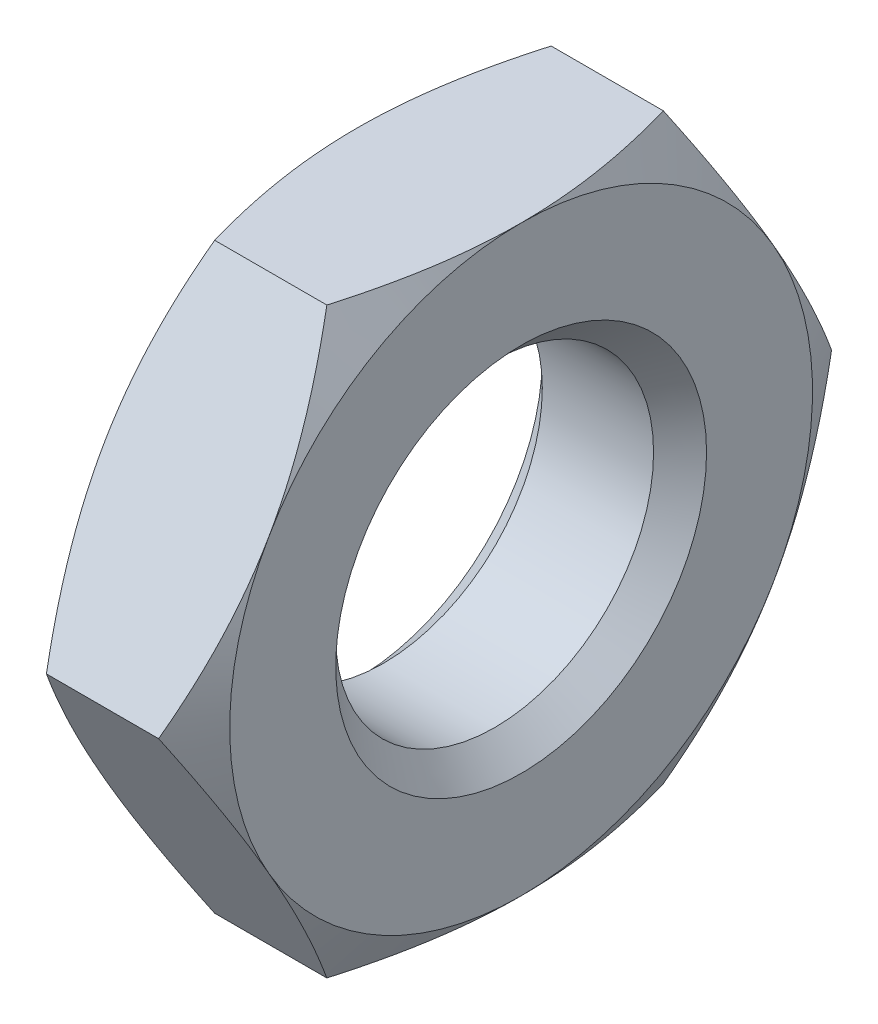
ISO-10303-21;
HEADER;
FILE_DESCRIPTION(('STEP AP214'),'2;1');
FILE_NAME('part.step','',(''),(''),'','','');
FILE_SCHEMA(('AUTOMOTIVE_DESIGN { 1 0 10303 214 1 1 1 1 }'));
ENDSEC;
DATA;
#1=APPLICATION_CONTEXT('core data for automotive mechanical design processes');
#2=APPLICATION_PROTOCOL_DEFINITION('international standard','automotive_design',2000,#1);
#3=PRODUCT_CONTEXT('',#1,'mechanical');
#4=PRODUCT('Part','Part','',(#3));
#5=PRODUCT_RELATED_PRODUCT_CATEGORY('part','',(#4));
#6=PRODUCT_DEFINITION_FORMATION('','',#4);
#7=PRODUCT_DEFINITION_CONTEXT('part definition',#1,'design');
#8=PRODUCT_DEFINITION('design','',#6,#7);
#9=PRODUCT_DEFINITION_SHAPE('','',#8);
#10=(LENGTH_UNIT() NAMED_UNIT(*) SI_UNIT(.MILLI.,.METRE.));
#11=(NAMED_UNIT(*) PLANE_ANGLE_UNIT() SI_UNIT($,.RADIAN.));
#12=(NAMED_UNIT(*) SI_UNIT($,.STERADIAN.) SOLID_ANGLE_UNIT());
#13=UNCERTAINTY_MEASURE_WITH_UNIT(LENGTH_MEASURE(1.E-05),#10,'distance_accuracy_value','');
#14=(GEOMETRIC_REPRESENTATION_CONTEXT(3) GLOBAL_UNCERTAINTY_ASSIGNED_CONTEXT((#13)) GLOBAL_UNIT_ASSIGNED_CONTEXT((#10,
#11,#12)) REPRESENTATION_CONTEXT('',''));
#15=CARTESIAN_POINT('',(0.,0.,0.));
#16=DIRECTION('',(0.,0.,1.));
#17=DIRECTION('',(1.,0.,0.));
#18=AXIS2_PLACEMENT_3D('',#15,#16,#17);
#19=CARTESIAN_POINT('',(1.55,2.75,-1.58771324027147));
#20=DIRECTION('',(1.,0.,0.));
#21=DIRECTION('',(0.,0.,-1.));
#22=AXIS2_PLACEMENT_3D('',#19,#20,#21);
#23=PLANE('',#22);
#24=CARTESIAN_POINT('',(1.55,0.,0.));
#25=DIRECTION('',(1.,0.,0.));
#26=DIRECTION('',(0.,0.,-1.));
#27=AXIS2_PLACEMENT_3D('',#24,#25,#26);
#28=CIRCLE('',#27,1.75);
#29=CARTESIAN_POINT('',(1.55,0.,-1.75));
#30=VERTEX_POINT('',#29);
#31=EDGE_CURVE('E11',#30,#30,#28,.F.);
#32=ORIENTED_EDGE('',*,*,#31,.T.);
#33=EDGE_LOOP('',(#32));
#34=FACE_BOUND('',#33,.T.);
#35=CARTESIAN_POINT('',(1.55,0.,0.));
#36=DIRECTION('',(1.,0.,0.));
#37=DIRECTION('',(0.,0.,-1.));
#38=AXIS2_PLACEMENT_3D('',#35,#36,#37);
#39=CIRCLE('',#38,2.75);
#40=CARTESIAN_POINT('',(1.55,-2.75,0.));
#41=VERTEX_POINT('',#40);
#42=CARTESIAN_POINT('',(1.55,-1.375,-2.38156986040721));
#43=VERTEX_POINT('',#42);
#44=EDGE_CURVE('E142',#41,#43,#39,.T.);
#45=ORIENTED_EDGE('',*,*,#44,.T.);
#46=CARTESIAN_POINT('',(1.55,1.375,-2.38156986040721));
#47=VERTEX_POINT('',#46);
#48=EDGE_CURVE('E130',#43,#47,#39,.T.);
#49=ORIENTED_EDGE('',*,*,#48,.T.);
#50=CARTESIAN_POINT('',(1.55,2.75,0.));
#51=VERTEX_POINT('',#50);
#52=EDGE_CURVE('E144',#47,#51,#39,.T.);
#53=ORIENTED_EDGE('',*,*,#52,.T.);
#54=CARTESIAN_POINT('',(1.55,1.375,2.38156986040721));
#55=VERTEX_POINT('',#54);
#56=EDGE_CURVE('E55',#51,#55,#39,.T.);
#57=ORIENTED_EDGE('',*,*,#56,.T.);
#58=CARTESIAN_POINT('',(1.55,-1.375,2.38156986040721));
#59=VERTEX_POINT('',#58);
#60=EDGE_CURVE('E63',#55,#59,#39,.T.);
#61=ORIENTED_EDGE('',*,*,#60,.T.);
#62=EDGE_CURVE('E166',#59,#41,#39,.T.);
#63=ORIENTED_EDGE('',*,*,#62,.T.);
#64=EDGE_LOOP('',(#45,#49,#53,#57,#61,#63));
#65=FACE_BOUND('',#64,.T.);
#66=ADVANCED_FACE('F39',(#34,#65),#23,.T.);
#67=CARTESIAN_POINT('',(0.,2.75,-1.58771324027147));
#68=DIRECTION('',(1.,0.,0.));
#69=DIRECTION('',(0.,0.,-1.));
#70=AXIS2_PLACEMENT_3D('',#67,#68,#69);
#71=PLANE('',#70);
#72=CARTESIAN_POINT('',(0.,0.,0.));
#73=DIRECTION('',(1.,0.,0.));
#74=DIRECTION('',(0.,0.,-1.));
#75=AXIS2_PLACEMENT_3D('',#72,#73,#74);
#76=CIRCLE('',#75,1.75);
#77=CARTESIAN_POINT('',(0.,0.,-1.75));
#78=VERTEX_POINT('',#77);
#79=EDGE_CURVE('E164',#78,#78,#76,.T.);
#80=ORIENTED_EDGE('',*,*,#79,.T.);
#81=EDGE_LOOP('',(#80));
#82=FACE_BOUND('',#81,.T.);
#83=CARTESIAN_POINT('',(0.,0.,0.));
#84=DIRECTION('',(1.,0.,0.));
#85=DIRECTION('',(0.,0.,-1.));
#86=AXIS2_PLACEMENT_3D('',#83,#84,#85);
#87=CIRCLE('',#86,2.75);
#88=CARTESIAN_POINT('',(0.,-1.375,-2.38156986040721));
#89=VERTEX_POINT('',#88);
#90=CARTESIAN_POINT('',(0.,1.375,-2.38156986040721));
#91=VERTEX_POINT('',#90);
#92=EDGE_CURVE('E173',#89,#91,#87,.T.);
#93=ORIENTED_EDGE('',*,*,#92,.F.);
#94=CARTESIAN_POINT('',(0.,-2.75,0.));
#95=VERTEX_POINT('',#94);
#96=EDGE_CURVE('E320',#95,#89,#87,.T.);
#97=ORIENTED_EDGE('',*,*,#96,.F.);
#98=CARTESIAN_POINT('',(0.,-1.375,2.38156986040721));
#99=VERTEX_POINT('',#98);
#100=EDGE_CURVE('E323',#99,#95,#87,.T.);
#101=ORIENTED_EDGE('',*,*,#100,.F.);
#102=CARTESIAN_POINT('',(0.,1.375,2.38156986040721));
#103=VERTEX_POINT('',#102);
#104=EDGE_CURVE('E328',#103,#99,#87,.T.);
#105=ORIENTED_EDGE('',*,*,#104,.F.);
#106=CARTESIAN_POINT('',(0.,2.75,0.));
#107=VERTEX_POINT('',#106);
#108=EDGE_CURVE('E178',#107,#103,#87,.T.);
#109=ORIENTED_EDGE('',*,*,#108,.F.);
#110=EDGE_CURVE('E174',#91,#107,#87,.T.);
#111=ORIENTED_EDGE('',*,*,#110,.F.);
#112=EDGE_LOOP('',(#93,#97,#101,#105,#109,#111));
#113=FACE_BOUND('',#112,.T.);
#114=ADVANCED_FACE('F321',(#82,#113),#71,.F.);
#115=CARTESIAN_POINT('',(1.55,0.,0.));
#116=DIRECTION('',(-1.,0.,0.));
#117=DIRECTION('',(0.,0.,1.));
#118=AXIS2_PLACEMENT_3D('',#115,#116,#117);
#119=CYLINDRICAL_SURFACE('',#118,1.5);
#120=CARTESIAN_POINT('',(0.249999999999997,0.,0.));
#121=DIRECTION('',(1.,0.,0.));
#122=DIRECTION('',(0.,0.,-1.));
#123=AXIS2_PLACEMENT_3D('',#120,#121,#122);
#124=CIRCLE('',#123,1.5);
#125=CARTESIAN_POINT('',(0.249999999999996,0.,1.5));
#126=VERTEX_POINT('',#125);
#127=EDGE_CURVE('E48',#126,#126,#124,.F.);
#128=CARTESIAN_POINT('',(1.3,0.,0.));
#129=DIRECTION('',(1.,0.,0.));
#130=DIRECTION('',(0.,0.,-1.));
#131=AXIS2_PLACEMENT_3D('',#128,#129,#130);
#132=CIRCLE('',#131,1.5);
#133=CARTESIAN_POINT('',(1.3,0.,1.5));
#134=VERTEX_POINT('',#133);
#135=EDGE_CURVE('E390',#134,#134,#132,.T.);
#136=CARTESIAN_POINT('',(0.249999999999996,0.,1.5));
#137=CARTESIAN_POINT('',(0.260937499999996,0.,1.5));
#138=CARTESIAN_POINT('',(0.271874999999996,0.,1.5));
#139=CARTESIAN_POINT('',(0.293749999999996,0.,1.5));
#140=CARTESIAN_POINT('',(0.304687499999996,0.,1.5));
#141=CARTESIAN_POINT('',(0.326562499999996,0.,1.5));
#142=CARTESIAN_POINT('',(0.337499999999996,0.,1.5));
#143=CARTESIAN_POINT('',(0.359374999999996,0.,1.5));
#144=CARTESIAN_POINT('',(0.370312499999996,0.,1.5));
#145=CARTESIAN_POINT('',(0.392187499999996,0.,1.5));
#146=CARTESIAN_POINT('',(0.403124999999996,0.,1.5));
#147=CARTESIAN_POINT('',(0.424999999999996,0.,1.5));
#148=CARTESIAN_POINT('',(0.435937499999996,0.,1.5));
#149=CARTESIAN_POINT('',(0.457812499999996,0.,1.5));
#150=CARTESIAN_POINT('',(0.468749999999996,0.,1.5));
#151=CARTESIAN_POINT('',(0.490624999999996,0.,1.5));
#152=CARTESIAN_POINT('',(0.501562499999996,0.,1.5));
#153=CARTESIAN_POINT('',(0.523437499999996,0.,1.5));
#154=CARTESIAN_POINT('',(0.534374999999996,0.,1.5));
#155=CARTESIAN_POINT('',(0.556249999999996,0.,1.5));
#156=CARTESIAN_POINT('',(0.567187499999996,0.,1.5));
#157=CARTESIAN_POINT('',(0.589062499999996,0.,1.5));
#158=CARTESIAN_POINT('',(0.599999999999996,0.,1.5));
#159=CARTESIAN_POINT('',(0.621874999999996,0.,1.5));
#160=CARTESIAN_POINT('',(0.632812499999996,0.,1.5));
#161=CARTESIAN_POINT('',(0.654687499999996,0.,1.5));
#162=CARTESIAN_POINT('',(0.665624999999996,0.,1.5));
#163=CARTESIAN_POINT('',(0.687499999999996,0.,1.5));
#164=CARTESIAN_POINT('',(0.698437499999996,0.,1.5));
#165=CARTESIAN_POINT('',(0.720312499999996,0.,1.5));
#166=CARTESIAN_POINT('',(0.731249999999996,0.,1.5));
#167=CARTESIAN_POINT('',(0.753124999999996,0.,1.5));
#168=CARTESIAN_POINT('',(0.764062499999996,0.,1.5));
#169=CARTESIAN_POINT('',(0.785937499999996,0.,1.5));
#170=CARTESIAN_POINT('',(0.796874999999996,0.,1.5));
#171=CARTESIAN_POINT('',(0.818749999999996,0.,1.5));
#172=CARTESIAN_POINT('',(0.829687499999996,0.,1.5));
#173=CARTESIAN_POINT('',(0.851562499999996,0.,1.5));
#174=CARTESIAN_POINT('',(0.862499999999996,0.,1.5));
#175=CARTESIAN_POINT('',(0.884374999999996,0.,1.5));
#176=CARTESIAN_POINT('',(0.895312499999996,0.,1.5));
#177=CARTESIAN_POINT('',(0.917187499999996,0.,1.5));
#178=CARTESIAN_POINT('',(0.928124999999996,0.,1.5));
#179=CARTESIAN_POINT('',(0.949999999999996,0.,1.5));
#180=CARTESIAN_POINT('',(0.960937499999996,0.,1.5));
#181=CARTESIAN_POINT('',(0.982812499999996,0.,1.5));
#182=CARTESIAN_POINT('',(0.993749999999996,0.,1.5));
#183=CARTESIAN_POINT('',(1.015625,0.,1.5));
#184=CARTESIAN_POINT('',(1.0265625,0.,1.5));
#185=CARTESIAN_POINT('',(1.0484375,0.,1.5));
#186=CARTESIAN_POINT('',(1.059375,0.,1.5));
#187=CARTESIAN_POINT('',(1.08125,0.,1.5));
#188=CARTESIAN_POINT('',(1.0921875,0.,1.5));
#189=CARTESIAN_POINT('',(1.1140625,0.,1.5));
#190=CARTESIAN_POINT('',(1.125,0.,1.5));
#191=CARTESIAN_POINT('',(1.146875,0.,1.5));
#192=CARTESIAN_POINT('',(1.1578125,0.,1.5));
#193=CARTESIAN_POINT('',(1.1796875,0.,1.5));
#194=CARTESIAN_POINT('',(1.190625,0.,1.5));
#195=CARTESIAN_POINT('',(1.2125,0.,1.5));
#196=CARTESIAN_POINT('',(1.2234375,0.,1.5));
#197=CARTESIAN_POINT('',(1.2453125,0.,1.5));
#198=CARTESIAN_POINT('',(1.25625,0.,1.5));
#199=CARTESIAN_POINT('',(1.278125,0.,1.5));
#200=CARTESIAN_POINT('',(1.2890625,0.,1.5));
#201=CARTESIAN_POINT('',(1.3,0.,1.5));
#202=B_SPLINE_CURVE_WITH_KNOTS('',3,(#136,#137,#138,#139,#140,#141,#142,#143,#144,#145,#146,
#147,#148,#149,#150,#151,#152,#153,#154,#155,#156,#157,#158,#159,#160,#161,#162,#163,#164,#165,
#166,#167,#168,#169,#170,#171,#172,#173,#174,#175,#176,#177,#178,#179,#180,#181,#182,#183,#184,
#185,#186,#187,#188,#189,#190,#191,#192,#193,#194,#195,#196,#197,#198,#199,#200,#201),
.UNSPECIFIED.,.F.,.F.,(4,2,2,2,2,2,2,2,2,2,2,2,2,2,2,2,2,2,2,2,2,2,2,2,2,2,2,2,2,2,2,2,4),(0.,
0.0328125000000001,0.0656249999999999,0.0984375,0.13125,0.1640625,0.196875,0.2296875,0.2625,
0.2953125,0.328125,0.3609375,0.39375,0.4265625,0.459375,0.4921875,0.525,0.5578125,0.590625,
0.6234375,0.65625,0.6890625,0.721875,0.7546875,0.7875,0.8203125,0.853124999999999,0.8859375,
0.91875,0.9515625,0.984375,1.0171875,1.05),.UNSPECIFIED.);
#203=EDGE_CURVE('BSEAM234',#126,#134,#202,.T.);
#204=ORIENTED_EDGE('',*,*,#127,.T.);
#205=ORIENTED_EDGE('',*,*,#135,.T.);
#206=ORIENTED_EDGE('',*,*,#203,.T.);
#207=ORIENTED_EDGE('',*,*,#203,.F.);
#208=EDGE_LOOP('',(#204,#206,#205,#207));
#209=FACE_BOUND('',#208,.T.);
#210=ADVANCED_FACE('F234',(#209),#119,.F.);
#211=CARTESIAN_POINT('',(0.,0.,0.));
#212=DIRECTION('',(1.,0.,0.));
#213=DIRECTION('',(0.,0.,-1.));
#214=AXIS2_PLACEMENT_3D('',#211,#212,#213);
#215=CONICAL_SURFACE('',#214,2.75,1.0471975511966);
#216=CARTESIAN_POINT('',(0.24568676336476,-2.7502,-1.58759777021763));
#217=CARTESIAN_POINT('',(0.205387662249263,-2.62935077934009,-1.65737010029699));
#218=CARTESIAN_POINT('',(0.168736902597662,-2.50745839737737,-1.72774469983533));
#219=CARTESIAN_POINT('',(0.1047621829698,-2.26156287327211,-1.86971254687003));
#220=CARTESIAN_POINT('',(0.077460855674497,-2.13755536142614,-1.94130831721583));
#221=CARTESIAN_POINT('',(0.0349617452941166,-1.89107720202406,-2.08361254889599));
#222=CARTESIAN_POINT('',(0.0194811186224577,-1.76864448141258,-2.15429911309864));
#223=CARTESIAN_POINT('',(0.000999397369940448,-1.52320285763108,-2.29600490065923));
#224=CARTESIAN_POINT('',(-0.00201700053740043,-1.40019484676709,-2.36702360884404));
#225=CARTESIAN_POINT('',(0.00425314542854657,-1.17034121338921,-2.49972966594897));
#226=CARTESIAN_POINT('',(0.0120001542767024,-1.06346120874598,-2.56143686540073));
#227=CARTESIAN_POINT('',(0.0365551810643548,-0.85039753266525,-2.68444923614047));
#228=CARTESIAN_POINT('',(0.0533715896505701,-0.744214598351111,-2.74575398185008));
#229=CARTESIAN_POINT('',(0.0954119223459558,-0.530711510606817,-2.86902004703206));
#230=CARTESIAN_POINT('',(0.12081408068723,-0.423418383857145,-2.93096576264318));
#231=CARTESIAN_POINT('',(0.178467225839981,-0.210432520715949,-3.05393320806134));
#232=CARTESIAN_POINT('',(0.210704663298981,-0.104737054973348,-3.11495651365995));
#233=CARTESIAN_POINT('',(0.245686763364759,0.000199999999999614,-3.17554195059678));
#234=B_SPLINE_CURVE_WITH_KNOTS('',3,(#216,#217,#218,#219,#220,#221,#222,#223,#224,#225,#226,
#227,#228,#229,#230,#231,#232,#233),.UNSPECIFIED.,.F.,.F.,(4,2,2,2,2,2,2,2,4),(0.,
0.435912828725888,0.872873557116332,1.29901931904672,1.72464171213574,2.09526089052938,
2.46622354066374,2.84541551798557,3.22386274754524),.UNSPECIFIED.);
#235=CARTESIAN_POINT('',(0.245620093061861,0.,-3.17542648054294));
#236=VERTEX_POINT('',#235);
#237=EDGE_CURVE('E334',#89,#236,#234,.T.);
#238=ORIENTED_EDGE('',*,*,#237,.F.);
#239=ORIENTED_EDGE('',*,*,#92,.T.);
#240=CARTESIAN_POINT('',(0.245686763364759,-0.000200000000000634,-3.17554195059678));
#241=CARTESIAN_POINT('',(0.205387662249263,0.120649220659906,-3.10576962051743));
#242=CARTESIAN_POINT('',(0.168736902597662,0.242541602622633,-3.03539502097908));
#243=CARTESIAN_POINT('',(0.1047621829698,0.488437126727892,-2.89342717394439));
#244=CARTESIAN_POINT('',(0.077460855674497,0.612444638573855,-2.82183140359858));
#245=CARTESIAN_POINT('',(0.0349617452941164,0.858922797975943,-2.67952717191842));
#246=CARTESIAN_POINT('',(0.0194811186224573,0.981355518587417,-2.60884060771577));
#247=CARTESIAN_POINT('',(0.000999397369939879,1.22679714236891,-2.46713482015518));
#248=CARTESIAN_POINT('',(-0.00201700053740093,1.34980515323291,-2.39611611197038));
#249=CARTESIAN_POINT('',(0.00425314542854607,1.57965878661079,-2.26341005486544));
#250=CARTESIAN_POINT('',(0.0120001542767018,1.68653879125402,-2.20170285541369));
#251=CARTESIAN_POINT('',(0.0365551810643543,1.89960246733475,-2.07869048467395));
#252=CARTESIAN_POINT('',(0.0533715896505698,2.00578540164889,-2.01738573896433));
#253=CARTESIAN_POINT('',(0.0954119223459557,2.21928848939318,-1.89411967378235));
#254=CARTESIAN_POINT('',(0.12081408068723,2.32658161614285,-1.83217395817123));
#255=CARTESIAN_POINT('',(0.178467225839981,2.53956747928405,-1.70920651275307));
#256=CARTESIAN_POINT('',(0.210704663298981,2.64526294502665,-1.64818320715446));
#257=CARTESIAN_POINT('',(0.245686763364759,2.7502,-1.58759777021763));
#258=B_SPLINE_CURVE_WITH_KNOTS('',3,(#240,#241,#242,#243,#244,#245,#246,#247,#248,#249,#250,
#251,#252,#253,#254,#255,#256,#257),.UNSPECIFIED.,.F.,.F.,(4,2,2,2,2,2,2,2,4),(0.,
0.435912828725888,0.872873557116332,1.29901931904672,1.72464171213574,2.09526089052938,
2.46622354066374,2.84541551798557,3.22386274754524),.UNSPECIFIED.);
#259=EDGE_CURVE('E215',#236,#91,#258,.T.);
#260=ORIENTED_EDGE('',*,*,#259,.F.);
#261=EDGE_LOOP('',(#238,#239,#260));
#262=FACE_BOUND('',#261,.T.);
#263=ADVANCED_FACE('F194',(#262),#215,.T.);
#264=ORIENTED_EDGE('',*,*,#96,.T.);
#265=CARTESIAN_POINT('',(0.245620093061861,-2.75,-1.58771324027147));
#266=VERTEX_POINT('',#265);
#267=EDGE_CURVE('E156',#266,#89,#234,.T.);
#268=ORIENTED_EDGE('',*,*,#267,.F.);
#269=CARTESIAN_POINT('',(1.35174952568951,-2.75,-4.28471983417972));
#270=CARTESIAN_POINT('',(1.29332489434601,-2.75,-4.16444353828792));
#271=CARTESIAN_POINT('',(1.23545471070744,-2.75,-4.04389327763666));
#272=CARTESIAN_POINT('',(1.12113466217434,-2.75,-3.80209921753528));
#273=CARTESIAN_POINT('',(1.06468501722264,-2.75,-3.68085531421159));
#274=CARTESIAN_POINT('',(0.953237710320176,-2.75,-3.43691315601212));
#275=CARTESIAN_POINT('',(0.898249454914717,-2.75,-3.3142105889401));
#276=CARTESIAN_POINT('',(0.790496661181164,-2.75,-3.06783650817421));
#277=CARTESIAN_POINT('',(0.737732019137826,-2.75,-2.94416503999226));
#278=CARTESIAN_POINT('',(0.63332883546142,-2.75,-2.69158244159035));
#279=CARTESIAN_POINT('',(0.581783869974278,-2.75,-2.56263242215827));
#280=CARTESIAN_POINT('',(0.48254701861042,-2.75,-2.3032310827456));
#281=CARTESIAN_POINT('',(0.43485556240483,-2.75,-2.17277959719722));
#282=CARTESIAN_POINT('',(0.344563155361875,-2.75,-1.91040563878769));
#283=CARTESIAN_POINT('',(0.301952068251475,-2.75,-1.77848668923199));
#284=CARTESIAN_POINT('',(0.223174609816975,-2.75,-1.5127563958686));
#285=CARTESIAN_POINT('',(0.187006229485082,-2.75,-1.37894565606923));
#286=CARTESIAN_POINT('',(0.123031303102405,-2.75,-1.11010614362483));
#287=CARTESIAN_POINT('',(0.0951784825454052,-2.75,-0.975088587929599));
#288=CARTESIAN_POINT('',(0.0493934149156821,-2.75,-0.703353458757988));
#289=CARTESIAN_POINT('',(0.0314601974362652,-2.75,-0.566636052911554));
#290=CARTESIAN_POINT('',(0.00717891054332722,-2.75,-0.293978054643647));
#291=CARTESIAN_POINT('',(0.000680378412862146,-2.75,-0.15805119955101));
#292=CARTESIAN_POINT('',(-0.00057792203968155,-2.75,0.113868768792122));
#293=CARTESIAN_POINT('',(0.00466247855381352,-2.75,0.24986188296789));
#294=CARTESIAN_POINT('',(0.0231036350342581,-2.75,0.480151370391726));
#295=CARTESIAN_POINT('',(0.0334375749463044,-2.75,0.57469192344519));
#296=CARTESIAN_POINT('',(0.0591457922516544,-2.75,0.763091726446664));
#297=CARTESIAN_POINT('',(0.0745207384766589,-2.75,0.856950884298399));
#298=CARTESIAN_POINT('',(0.127402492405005,-2.75,1.13736309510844));
#299=CARTESIAN_POINT('',(0.171656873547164,-2.75,1.32264796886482));
#300=CARTESIAN_POINT('',(0.274479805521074,-2.75,1.69350481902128));
#301=CARTESIAN_POINT('',(0.333345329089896,-2.75,1.87899120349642));
#302=CARTESIAN_POINT('',(0.428854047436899,-2.75,2.15464192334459));
#303=CARTESIAN_POINT('',(0.461888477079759,-2.75,2.24608695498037));
#304=CARTESIAN_POINT('',(0.529983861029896,-2.75,2.42821923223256));
#305=CARTESIAN_POINT('',(0.565044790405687,-2.75,2.51890648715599));
#306=CARTESIAN_POINT('',(0.650730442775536,-2.75,2.73453096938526));
#307=CARTESIAN_POINT('',(0.70213292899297,-2.75,2.85915823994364));
#308=CARTESIAN_POINT('',(0.807488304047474,-2.75,3.10733287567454));
#309=CARTESIAN_POINT('',(0.861441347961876,-2.75,3.23088017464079));
#310=CARTESIAN_POINT('',(1.02632611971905,-2.75,3.60022960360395));
#311=CARTESIAN_POINT('',(1.14026268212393,-2.75,3.84468826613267));
#312=CARTESIAN_POINT('',(1.37341783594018,-2.75,4.33136304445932));
#313=CARTESIAN_POINT('',(1.49264189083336,-2.75,4.57357651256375));
#314=CARTESIAN_POINT('',(1.7346225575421,-2.75,5.05623934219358));
#315=CARTESIAN_POINT('',(1.85737930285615,-2.75,5.29668863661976));
#316=CARTESIAN_POINT('',(2.09479336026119,-2.75,5.75582687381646));
#317=CARTESIAN_POINT('',(2.20924755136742,-2.75,5.97462122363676));
#318=CARTESIAN_POINT('',(2.43971917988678,-2.75,6.41139457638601));
#319=CARTESIAN_POINT('',(2.55573667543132,-2.75,6.62937354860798));
#320=CARTESIAN_POINT('',(2.78865939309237,-2.75,7.06413326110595));
#321=CARTESIAN_POINT('',(2.90556155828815,-2.75,7.28091564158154));
#322=CARTESIAN_POINT('',(3.14029697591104,-2.75,7.71395988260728));
#323=CARTESIAN_POINT('',(3.25813017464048,-2.75,7.9302217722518));
#324=CARTESIAN_POINT('',(3.37631013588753,-2.75,8.14629266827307));
#325=B_SPLINE_CURVE_WITH_KNOTS('',3,(#269,#270,#271,#272,#273,#274,#275,#276,#277,#278,#279,
#280,#281,#282,#283,#284,#285,#286,#287,#288,#289,#290,#291,#292,#293,#294,#295,#296,#297,#298,
#299,#300,#301,#302,#303,#304,#305,#306,#307,#308,#309,#310,#311,#312,#313,#314,#315,#316,#317,
#318,#319,#320,#321,#322,#323,#324),.UNSPECIFIED.,.F.,.F.,(4,2,2,2,2,2,2,2,2,2,2,2,2,2,2,2,2,2,
2,2,2,2,2,2,2,2,2,4),(0.,0.401151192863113,0.802364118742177,1.20572796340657,1.60907297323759,
2.02563659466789,2.44224659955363,2.85801096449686,3.2736454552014,3.68692195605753,
4.10015802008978,4.50791469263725,4.91567723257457,5.20085135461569,5.48606332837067,
6.05679584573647,6.64024524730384,6.9319134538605,7.22357807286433,7.62797517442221,
8.03239689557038,8.84140548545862,9.65127042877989,10.4611660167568,11.2019262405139,
11.9427140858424,12.6815935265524,13.4204306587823),.UNSPECIFIED.);
#326=EDGE_CURVE('E177',#95,#266,#325,.F.);
#327=ORIENTED_EDGE('',*,*,#326,.F.);
#328=EDGE_LOOP('',(#264,#268,#327));
#329=FACE_BOUND('',#328,.T.);
#330=ADVANCED_FACE('F351',(#329),#215,.T.);
#331=CARTESIAN_POINT('',(0.775,0.,0.));
#332=DIRECTION('',(-1.,0.,0.));
#333=DIRECTION('',(0.,0.,1.));
#334=AXIS2_PLACEMENT_3D('',#331,#332,#333);
#335=CONICAL_SURFACE('',#334,4.09233937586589,1.0471975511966);
#336=CARTESIAN_POINT('',(1.30431323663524,0.000199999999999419,-3.17554195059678));
#337=CARTESIAN_POINT('',(1.34461233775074,-0.120649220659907,-3.10576962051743));
#338=CARTESIAN_POINT('',(1.38126309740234,-0.242541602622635,-3.03539502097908));
#339=CARTESIAN_POINT('',(1.4452378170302,-0.488437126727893,-2.89342717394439));
#340=CARTESIAN_POINT('',(1.4725391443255,-0.612444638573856,-2.82183140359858));
#341=CARTESIAN_POINT('',(1.51503825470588,-0.858922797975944,-2.67952717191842));
#342=CARTESIAN_POINT('',(1.53051888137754,-0.981355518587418,-2.60884060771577));
#343=CARTESIAN_POINT('',(1.54900060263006,-1.22679714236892,-2.46713482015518));
#344=CARTESIAN_POINT('',(1.5520170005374,-1.34980515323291,-2.39611611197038));
#345=CARTESIAN_POINT('',(1.54574685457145,-1.57965878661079,-2.26341005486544));
#346=CARTESIAN_POINT('',(1.5379998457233,-1.68653879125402,-2.20170285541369));
#347=CARTESIAN_POINT('',(1.51344481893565,-1.89960246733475,-2.07869048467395));
#348=CARTESIAN_POINT('',(1.49662841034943,-2.00578540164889,-2.01738573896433));
#349=CARTESIAN_POINT('',(1.45458807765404,-2.21928848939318,-1.89411967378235));
#350=CARTESIAN_POINT('',(1.42918591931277,-2.32658161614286,-1.83217395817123));
#351=CARTESIAN_POINT('',(1.37153277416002,-2.53956747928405,-1.70920651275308));
#352=CARTESIAN_POINT('',(1.33929533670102,-2.64526294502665,-1.64818320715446));
#353=CARTESIAN_POINT('',(1.30431323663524,-2.7502,-1.58759777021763));
#354=B_SPLINE_CURVE_WITH_KNOTS('',3,(#336,#337,#338,#339,#340,#341,#342,#343,#344,#345,#346,
#347,#348,#349,#350,#351,#352,#353),.UNSPECIFIED.,.F.,.F.,(4,2,2,2,2,2,2,2,4),(0.,
0.435912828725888,0.872873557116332,1.29901931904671,1.72464171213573,2.09526089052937,
2.46622354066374,2.84541551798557,3.22386274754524),.UNSPECIFIED.);
#355=CARTESIAN_POINT('',(1.30437990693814,-2.75,-1.58771324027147));
#356=VERTEX_POINT('',#355);
#357=EDGE_CURVE('E147',#43,#356,#354,.T.);
#358=ORIENTED_EDGE('',*,*,#357,.F.);
#359=ORIENTED_EDGE('',*,*,#44,.F.);
#360=CARTESIAN_POINT('',(0.198250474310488,-2.75,-4.28471983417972));
#361=CARTESIAN_POINT('',(0.25667510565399,-2.75,-4.16444353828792));
#362=CARTESIAN_POINT('',(0.31454528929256,-2.75,-4.04389327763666));
#363=CARTESIAN_POINT('',(0.428865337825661,-2.75,-3.80209921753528));
#364=CARTESIAN_POINT('',(0.485314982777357,-2.75,-3.68085531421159));
#365=CARTESIAN_POINT('',(0.596762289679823,-2.75,-3.43691315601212));
#366=CARTESIAN_POINT('',(0.651750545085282,-2.75,-3.3142105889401));
#367=CARTESIAN_POINT('',(0.759503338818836,-2.75,-3.06783650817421));
#368=CARTESIAN_POINT('',(0.812267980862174,-2.75,-2.94416503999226));
#369=CARTESIAN_POINT('',(0.91667116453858,-2.75,-2.69158244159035));
#370=CARTESIAN_POINT('',(0.968216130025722,-2.75,-2.56263242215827));
#371=CARTESIAN_POINT('',(1.06745298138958,-2.75,-2.3032310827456));
#372=CARTESIAN_POINT('',(1.11514443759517,-2.75,-2.17277959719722));
#373=CARTESIAN_POINT('',(1.20543684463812,-2.75,-1.91040563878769));
#374=CARTESIAN_POINT('',(1.24804793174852,-2.75,-1.77848668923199));
#375=CARTESIAN_POINT('',(1.32682539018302,-2.75,-1.5127563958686));
#376=CARTESIAN_POINT('',(1.36299377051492,-2.75,-1.37894565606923));
#377=CARTESIAN_POINT('',(1.4269686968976,-2.75,-1.11010614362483));
#378=CARTESIAN_POINT('',(1.45482151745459,-2.75,-0.9750885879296));
#379=CARTESIAN_POINT('',(1.50060658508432,-2.75,-0.703353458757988));
#380=CARTESIAN_POINT('',(1.51853980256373,-2.75,-0.566636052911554));
#381=CARTESIAN_POINT('',(1.54282108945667,-2.75,-0.293978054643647));
#382=CARTESIAN_POINT('',(1.54931962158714,-2.75,-0.15805119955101));
#383=CARTESIAN_POINT('',(1.55057792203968,-2.75,0.113868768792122));
#384=CARTESIAN_POINT('',(1.54533752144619,-2.75,0.249861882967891));
#385=CARTESIAN_POINT('',(1.52689636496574,-2.75,0.480151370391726));
#386=CARTESIAN_POINT('',(1.5165624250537,-2.75,0.57469192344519));
#387=CARTESIAN_POINT('',(1.49085420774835,-2.75,0.763091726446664));
#388=CARTESIAN_POINT('',(1.47547926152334,-2.75,0.856950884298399));
#389=CARTESIAN_POINT('',(1.42259750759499,-2.75,1.13736309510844));
#390=CARTESIAN_POINT('',(1.37834312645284,-2.75,1.32264796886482));
#391=CARTESIAN_POINT('',(1.27552019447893,-2.75,1.69350481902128));
#392=CARTESIAN_POINT('',(1.2166546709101,-2.75,1.87899120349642));
#393=CARTESIAN_POINT('',(1.1211459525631,-2.75,2.15464192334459));
#394=CARTESIAN_POINT('',(1.08811152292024,-2.75,2.24608695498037));
#395=CARTESIAN_POINT('',(1.0200161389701,-2.75,2.42821923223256));
#396=CARTESIAN_POINT('',(0.984955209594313,-2.75,2.51890648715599));
#397=CARTESIAN_POINT('',(0.899269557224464,-2.75,2.73453096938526));
#398=CARTESIAN_POINT('',(0.84786707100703,-2.75,2.85915823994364));
#399=CARTESIAN_POINT('',(0.742511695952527,-2.75,3.10733287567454));
#400=CARTESIAN_POINT('',(0.688558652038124,-2.75,3.23088017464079));
#401=CARTESIAN_POINT('',(0.523673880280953,-2.75,3.60022960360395));
#402=CARTESIAN_POINT('',(0.409737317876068,-2.75,3.84468826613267));
#403=CARTESIAN_POINT('',(0.176582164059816,-2.75,4.33136304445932));
#404=CARTESIAN_POINT('',(0.0573581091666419,-2.75,4.57357651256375));
#405=CARTESIAN_POINT('',(-0.1846225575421,-2.75,5.05623934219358));
#406=CARTESIAN_POINT('',(-0.307379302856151,-2.75,5.29668863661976));
#407=CARTESIAN_POINT('',(-0.54479336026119,-2.75,5.75582687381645));
#408=CARTESIAN_POINT('',(-0.659247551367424,-2.75,5.97462122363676));
#409=CARTESIAN_POINT('',(-0.889719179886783,-2.75,6.41139457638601));
#410=CARTESIAN_POINT('',(-1.00573667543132,-2.75,6.62937354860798));
#411=CARTESIAN_POINT('',(-1.23865939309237,-2.75,7.06413326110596));
#412=CARTESIAN_POINT('',(-1.35556155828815,-2.75,7.28091564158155));
#413=CARTESIAN_POINT('',(-1.59029697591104,-2.75,7.71395988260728));
#414=CARTESIAN_POINT('',(-1.70813017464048,-2.75,7.9302217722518));
#415=CARTESIAN_POINT('',(-1.82631013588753,-2.75,8.14629266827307));
#416=B_SPLINE_CURVE_WITH_KNOTS('',3,(#360,#361,#362,#363,#364,#365,#366,#367,#368,#369,#370,
#371,#372,#373,#374,#375,#376,#377,#378,#379,#380,#381,#382,#383,#384,#385,#386,#387,#388,#389,
#390,#391,#392,#393,#394,#395,#396,#397,#398,#399,#400,#401,#402,#403,#404,#405,#406,#407,#408,
#409,#410,#411,#412,#413,#414,#415),.UNSPECIFIED.,.F.,.F.,(4,2,2,2,2,2,2,2,2,2,2,2,2,2,2,2,2,2,
2,2,2,2,2,2,2,2,2,4),(0.,0.401151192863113,0.802364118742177,1.20572796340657,1.60907297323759,
2.02563659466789,2.44224659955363,2.85801096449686,3.2736454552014,3.68692195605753,
4.10015802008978,4.50791469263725,4.91567723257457,5.20085135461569,5.48606332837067,
6.05679584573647,6.64024524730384,6.9319134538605,7.22357807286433,7.62797517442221,
8.03239689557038,8.84140548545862,9.65127042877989,10.4611660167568,11.2019262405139,
11.9427140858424,12.6815935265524,13.4204306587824),.UNSPECIFIED.);
#417=EDGE_CURVE('E151',#356,#41,#416,.T.);
#418=ORIENTED_EDGE('',*,*,#417,.F.);
#419=EDGE_LOOP('',(#358,#359,#418));
#420=FACE_BOUND('',#419,.T.);
#421=ADVANCED_FACE('F148',(#420),#335,.T.);
#422=ORIENTED_EDGE('',*,*,#48,.F.);
#423=CARTESIAN_POINT('',(1.30437990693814,0.,-3.17542648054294));
#424=VERTEX_POINT('',#423);
#425=EDGE_CURVE('E134',#424,#43,#354,.T.);
#426=ORIENTED_EDGE('',*,*,#425,.F.);
#427=CARTESIAN_POINT('',(1.30431323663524,2.7502,-1.58759777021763));
#428=CARTESIAN_POINT('',(1.34461233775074,2.62935077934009,-1.65737010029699));
#429=CARTESIAN_POINT('',(1.38126309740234,2.50745839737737,-1.72774469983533));
#430=CARTESIAN_POINT('',(1.4452378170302,2.26156287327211,-1.86971254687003));
#431=CARTESIAN_POINT('',(1.4725391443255,2.13755536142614,-1.94130831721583));
#432=CARTESIAN_POINT('',(1.51503825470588,1.89107720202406,-2.08361254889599));
#433=CARTESIAN_POINT('',(1.53051888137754,1.76864448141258,-2.15429911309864));
#434=CARTESIAN_POINT('',(1.54900060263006,1.52320285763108,-2.29600490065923));
#435=CARTESIAN_POINT('',(1.5520170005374,1.40019484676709,-2.36702360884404));
#436=CARTESIAN_POINT('',(1.54574685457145,1.17034121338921,-2.49972966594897));
#437=CARTESIAN_POINT('',(1.5379998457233,1.06346120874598,-2.56143686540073));
#438=CARTESIAN_POINT('',(1.51344481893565,0.85039753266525,-2.68444923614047));
#439=CARTESIAN_POINT('',(1.49662841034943,0.74421459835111,-2.74575398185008));
#440=CARTESIAN_POINT('',(1.45458807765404,0.530711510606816,-2.86902004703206));
#441=CARTESIAN_POINT('',(1.42918591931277,0.423418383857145,-2.93096576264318));
#442=CARTESIAN_POINT('',(1.37153277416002,0.210432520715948,-3.05393320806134));
#443=CARTESIAN_POINT('',(1.33929533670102,0.104737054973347,-3.11495651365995));
#444=CARTESIAN_POINT('',(1.30431323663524,-0.000200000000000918,-3.17554195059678));
#445=B_SPLINE_CURVE_WITH_KNOTS('',3,(#427,#428,#429,#430,#431,#432,#433,#434,#435,#436,#437,
#438,#439,#440,#441,#442,#443,#444),.UNSPECIFIED.,.F.,.F.,(4,2,2,2,2,2,2,2,4),(0.,
0.435912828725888,0.872873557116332,1.29901931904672,1.72464171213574,2.09526089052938,
2.46622354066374,2.84541551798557,3.22386274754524),.UNSPECIFIED.);
#446=EDGE_CURVE('E136',#47,#424,#445,.T.);
#447=ORIENTED_EDGE('',*,*,#446,.F.);
#448=EDGE_LOOP('',(#422,#426,#447));
#449=FACE_BOUND('',#448,.T.);
#450=ADVANCED_FACE('F132',(#449),#335,.T.);
#451=ORIENTED_EDGE('',*,*,#100,.T.);
#452=CARTESIAN_POINT('',(0.245620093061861,-2.75,1.58771324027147));
#453=VERTEX_POINT('',#452);
#454=EDGE_CURVE('E187',#453,#95,#325,.F.);
#455=ORIENTED_EDGE('',*,*,#454,.F.);
#456=CARTESIAN_POINT('',(0.245686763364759,0.000200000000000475,3.17554195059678));
#457=CARTESIAN_POINT('',(0.205387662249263,-0.120649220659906,3.10576962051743));
#458=CARTESIAN_POINT('',(0.168736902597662,-0.242541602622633,3.03539502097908));
#459=CARTESIAN_POINT('',(0.1047621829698,-0.488437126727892,2.89342717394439));
#460=CARTESIAN_POINT('',(0.077460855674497,-0.612444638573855,2.82183140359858));
#461=CARTESIAN_POINT('',(0.0349617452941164,-0.858922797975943,2.67952717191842));
#462=CARTESIAN_POINT('',(0.0194811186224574,-0.981355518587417,2.60884060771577));
#463=CARTESIAN_POINT('',(0.000999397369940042,-1.22679714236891,2.46713482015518));
#464=CARTESIAN_POINT('',(-0.00201700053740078,-1.34980515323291,2.39611611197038));
#465=CARTESIAN_POINT('',(0.00425314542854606,-1.57965878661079,2.26341005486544));
#466=CARTESIAN_POINT('',(0.0120001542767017,-1.68653879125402,2.20170285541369));
#467=CARTESIAN_POINT('',(0.0365551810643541,-1.89960246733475,2.07869048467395));
#468=CARTESIAN_POINT('',(0.0533715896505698,-2.00578540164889,2.01738573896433));
#469=CARTESIAN_POINT('',(0.0954119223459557,-2.21928848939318,1.89411967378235));
#470=CARTESIAN_POINT('',(0.12081408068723,-2.32658161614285,1.83217395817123));
#471=CARTESIAN_POINT('',(0.178467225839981,-2.53956747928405,1.70920651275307));
#472=CARTESIAN_POINT('',(0.210704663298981,-2.64526294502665,1.64818320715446));
#473=CARTESIAN_POINT('',(0.245686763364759,-2.7502,1.58759777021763));
#474=B_SPLINE_CURVE_WITH_KNOTS('',3,(#456,#457,#458,#459,#460,#461,#462,#463,#464,#465,#466,
#467,#468,#469,#470,#471,#472,#473),.UNSPECIFIED.,.F.,.F.,(4,2,2,2,2,2,2,2,4),(0.,
0.435912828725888,0.872873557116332,1.29901931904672,1.72464171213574,2.09526089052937,
2.46622354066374,2.84541551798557,3.22386274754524),.UNSPECIFIED.);
#475=EDGE_CURVE('E188',#99,#453,#474,.T.);
#476=ORIENTED_EDGE('',*,*,#475,.F.);
#477=EDGE_LOOP('',(#451,#455,#476));
#478=FACE_BOUND('',#477,.T.);
#479=ADVANCED_FACE('F350',(#478),#215,.T.);
#480=CARTESIAN_POINT('',(1.30437990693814,-2.75,1.58771324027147));
#481=VERTEX_POINT('',#480);
#482=EDGE_CURVE('E216',#41,#481,#416,.T.);
#483=ORIENTED_EDGE('',*,*,#482,.F.);
#484=ORIENTED_EDGE('',*,*,#62,.F.);
#485=CARTESIAN_POINT('',(1.30431323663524,-2.7502,1.58759777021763));
#486=CARTESIAN_POINT('',(1.34461233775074,-2.62935077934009,1.65737010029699));
#487=CARTESIAN_POINT('',(1.38126309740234,-2.50745839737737,1.72774469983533));
#488=CARTESIAN_POINT('',(1.4452378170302,-2.26156287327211,1.86971254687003));
#489=CARTESIAN_POINT('',(1.4725391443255,-2.13755536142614,1.94130831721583));
#490=CARTESIAN_POINT('',(1.51503825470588,-1.89107720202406,2.08361254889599));
#491=CARTESIAN_POINT('',(1.53051888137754,-1.76864448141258,2.15429911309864));
#492=CARTESIAN_POINT('',(1.54900060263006,-1.52320285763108,2.29600490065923));
#493=CARTESIAN_POINT('',(1.5520170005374,-1.40019484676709,2.36702360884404));
#494=CARTESIAN_POINT('',(1.54574685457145,-1.17034121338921,2.49972966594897));
#495=CARTESIAN_POINT('',(1.5379998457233,-1.06346120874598,2.56143686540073));
#496=CARTESIAN_POINT('',(1.51344481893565,-0.85039753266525,2.68444923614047));
#497=CARTESIAN_POINT('',(1.49662841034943,-0.74421459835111,2.74575398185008));
#498=CARTESIAN_POINT('',(1.45458807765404,-0.530711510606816,2.86902004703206));
#499=CARTESIAN_POINT('',(1.42918591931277,-0.423418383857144,2.93096576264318));
#500=CARTESIAN_POINT('',(1.37153277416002,-0.210432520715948,3.05393320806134));
#501=CARTESIAN_POINT('',(1.33929533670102,-0.104737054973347,3.11495651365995));
#502=CARTESIAN_POINT('',(1.30431323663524,0.000200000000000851,3.17554195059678));
#503=B_SPLINE_CURVE_WITH_KNOTS('',3,(#485,#486,#487,#488,#489,#490,#491,#492,#493,#494,#495,
#496,#497,#498,#499,#500,#501,#502),.UNSPECIFIED.,.F.,.F.,(4,2,2,2,2,2,2,2,4),(0.,
0.435912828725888,0.872873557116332,1.29901931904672,1.72464171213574,2.09526089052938,
2.46622354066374,2.84541551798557,3.22386274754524),.UNSPECIFIED.);
#504=EDGE_CURVE('E247',#481,#59,#503,.T.);
#505=ORIENTED_EDGE('',*,*,#504,.F.);
#506=EDGE_LOOP('',(#483,#484,#505));
#507=FACE_BOUND('',#506,.T.);
#508=ADVANCED_FACE('F429',(#507),#335,.T.);
#509=ORIENTED_EDGE('',*,*,#104,.T.);
#510=CARTESIAN_POINT('',(0.245620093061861,0.,3.17542648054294));
#511=VERTEX_POINT('',#510);
#512=EDGE_CURVE('E288',#511,#99,#474,.T.);
#513=ORIENTED_EDGE('',*,*,#512,.F.);
#514=CARTESIAN_POINT('',(0.24568676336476,2.7502,1.58759777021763));
#515=CARTESIAN_POINT('',(0.205387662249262,2.62935077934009,1.65737010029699));
#516=CARTESIAN_POINT('',(0.168736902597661,2.50745839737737,1.72774469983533));
#517=CARTESIAN_POINT('',(0.1047621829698,2.26156287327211,1.86971254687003));
#518=CARTESIAN_POINT('',(0.077460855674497,2.13755536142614,1.94130831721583));
#519=CARTESIAN_POINT('',(0.0349617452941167,1.89107720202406,2.08361254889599));
#520=CARTESIAN_POINT('',(0.0194811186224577,1.76864448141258,2.15429911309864));
#521=CARTESIAN_POINT('',(0.000999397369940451,1.52320285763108,2.29600490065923));
#522=CARTESIAN_POINT('',(-0.00201700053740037,1.40019484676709,2.36702360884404));
#523=CARTESIAN_POINT('',(0.00425314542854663,1.17034121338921,2.49972966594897));
#524=CARTESIAN_POINT('',(0.0120001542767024,1.06346120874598,2.56143686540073));
#525=CARTESIAN_POINT('',(0.0365551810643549,0.85039753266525,2.68444923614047));
#526=CARTESIAN_POINT('',(0.0533715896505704,0.744214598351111,2.74575398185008));
#527=CARTESIAN_POINT('',(0.0954119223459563,0.530711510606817,2.86902004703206));
#528=CARTESIAN_POINT('',(0.120814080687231,0.423418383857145,2.93096576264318));
#529=CARTESIAN_POINT('',(0.178467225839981,0.210432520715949,3.05393320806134));
#530=CARTESIAN_POINT('',(0.210704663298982,0.104737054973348,3.11495651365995));
#531=CARTESIAN_POINT('',(0.24568676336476,-0.000199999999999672,3.17554195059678));
#532=B_SPLINE_CURVE_WITH_KNOTS('',3,(#514,#515,#516,#517,#518,#519,#520,#521,#522,#523,#524,
#525,#526,#527,#528,#529,#530,#531),.UNSPECIFIED.,.F.,.F.,(4,2,2,2,2,2,2,2,4),(0.,
0.435912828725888,0.872873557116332,1.29901931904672,1.72464171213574,2.09526089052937,
2.46622354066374,2.84541551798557,3.22386274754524),.UNSPECIFIED.);
#533=EDGE_CURVE('E282',#103,#511,#532,.T.);
#534=ORIENTED_EDGE('',*,*,#533,.F.);
#535=EDGE_LOOP('',(#509,#513,#534));
#536=FACE_BOUND('',#535,.T.);
#537=ADVANCED_FACE('F232',(#536),#215,.T.);
#538=CARTESIAN_POINT('',(1.30437990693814,0.,3.17542648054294));
#539=VERTEX_POINT('',#538);
#540=EDGE_CURVE('E377',#59,#539,#503,.T.);
#541=ORIENTED_EDGE('',*,*,#540,.F.);
#542=ORIENTED_EDGE('',*,*,#60,.F.);
#543=CARTESIAN_POINT('',(1.30431323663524,-0.000199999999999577,3.17554195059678));
#544=CARTESIAN_POINT('',(1.34461233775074,0.120649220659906,3.10576962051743));
#545=CARTESIAN_POINT('',(1.38126309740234,0.242541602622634,3.03539502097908));
#546=CARTESIAN_POINT('',(1.4452378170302,0.488437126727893,2.89342717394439));
#547=CARTESIAN_POINT('',(1.4725391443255,0.612444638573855,2.82183140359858));
#548=CARTESIAN_POINT('',(1.51503825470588,0.858922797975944,2.67952717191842));
#549=CARTESIAN_POINT('',(1.53051888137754,0.981355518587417,2.60884060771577));
#550=CARTESIAN_POINT('',(1.54900060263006,1.22679714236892,2.46713482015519));
#551=CARTESIAN_POINT('',(1.5520170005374,1.34980515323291,2.39611611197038));
#552=CARTESIAN_POINT('',(1.54574685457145,1.57965878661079,2.26341005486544));
#553=CARTESIAN_POINT('',(1.5379998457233,1.68653879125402,2.20170285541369));
#554=CARTESIAN_POINT('',(1.51344481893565,1.89960246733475,2.07869048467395));
#555=CARTESIAN_POINT('',(1.49662841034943,2.00578540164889,2.01738573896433));
#556=CARTESIAN_POINT('',(1.45458807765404,2.21928848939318,1.89411967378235));
#557=CARTESIAN_POINT('',(1.42918591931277,2.32658161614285,1.83217395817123));
#558=CARTESIAN_POINT('',(1.37153277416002,2.53956747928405,1.70920651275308));
#559=CARTESIAN_POINT('',(1.33929533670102,2.64526294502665,1.64818320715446));
#560=CARTESIAN_POINT('',(1.30431323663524,2.7502,1.58759777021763));
#561=B_SPLINE_CURVE_WITH_KNOTS('',3,(#543,#544,#545,#546,#547,#548,#549,#550,#551,#552,#553,
#554,#555,#556,#557,#558,#559,#560),.UNSPECIFIED.,.F.,.F.,(4,2,2,2,2,2,2,2,4),(0.,
0.435912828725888,0.872873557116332,1.29901931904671,1.72464171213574,2.09526089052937,
2.46622354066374,2.84541551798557,3.22386274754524),.UNSPECIFIED.);
#562=EDGE_CURVE('E370',#539,#55,#561,.T.);
#563=ORIENTED_EDGE('',*,*,#562,.F.);
#564=EDGE_LOOP('',(#541,#542,#563));
#565=FACE_BOUND('',#564,.T.);
#566=ADVANCED_FACE('F227',(#565),#335,.T.);
#567=ORIENTED_EDGE('',*,*,#108,.T.);
#568=CARTESIAN_POINT('',(0.245620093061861,2.75,1.58771324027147));
#569=VERTEX_POINT('',#568);
#570=EDGE_CURVE('E281',#569,#103,#532,.T.);
#571=ORIENTED_EDGE('',*,*,#570,.F.);
#572=CARTESIAN_POINT('',(1.35174952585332,2.75,-4.28471983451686));
#573=CARTESIAN_POINT('',(1.29332489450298,2.75,-4.16444353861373));
#574=CARTESIAN_POINT('',(1.23545471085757,2.75,-4.04389327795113));
#575=CARTESIAN_POINT('',(1.12113466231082,2.75,-3.80209921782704));
#576=CARTESIAN_POINT('',(1.06468501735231,2.75,-3.68085531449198));
#577=CARTESIAN_POINT('',(0.953237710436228,2.75,-3.43691315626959));
#578=CARTESIAN_POINT('',(0.898249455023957,2.75,-3.31421058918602));
#579=CARTESIAN_POINT('',(0.790496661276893,2.75,-3.06783650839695));
#580=CARTESIAN_POINT('',(0.737732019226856,2.75,-2.94416504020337));
#581=CARTESIAN_POINT('',(0.63332883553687,2.75,-2.69158244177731));
#582=CARTESIAN_POINT('',(0.581783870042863,2.75,-2.56263242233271));
#583=CARTESIAN_POINT('',(0.482547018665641,2.75,-2.30323108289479));
#584=CARTESIAN_POINT('',(0.434855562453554,2.75,-2.17277959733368));
#585=CARTESIAN_POINT('',(0.344563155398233,2.75,-1.91040563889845));
#586=CARTESIAN_POINT('',(0.301952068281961,2.75,-1.77848668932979));
#587=CARTESIAN_POINT('',(0.223174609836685,2.75,-1.51275639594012));
#588=CARTESIAN_POINT('',(0.187006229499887,2.75,-1.37894565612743));
#589=CARTESIAN_POINT('',(0.123031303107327,2.75,-1.1101061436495));
#590=CARTESIAN_POINT('',(0.095178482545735,2.75,-0.97508858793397));
#591=CARTESIAN_POINT('',(0.0493934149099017,2.75,-0.703353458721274));
#592=CARTESIAN_POINT('',(0.0314601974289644,2.75,-0.566636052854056));
#593=CARTESIAN_POINT('',(0.00717891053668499,2.75,-0.293978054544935));
#594=CARTESIAN_POINT('',(0.000680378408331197,2.75,-0.158051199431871));
#595=CARTESIAN_POINT('',(-0.00057792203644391,2.75,0.113868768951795));
#596=CARTESIAN_POINT('',(0.00466247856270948,2.75,0.249861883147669));
#597=CARTESIAN_POINT('',(0.0231036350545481,2.75,0.480151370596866));
#598=CARTESIAN_POINT('',(0.0334375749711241,2.75,0.574691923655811));
#599=CARTESIAN_POINT('',(0.0591457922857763,2.75,0.763091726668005));
#600=CARTESIAN_POINT('',(0.0745207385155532,2.75,0.856950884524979));
#601=CARTESIAN_POINT('',(0.12740249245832,2.75,1.13736309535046));
#602=CARTESIAN_POINT('',(0.171656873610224,2.75,1.32264796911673));
#603=CARTESIAN_POINT('',(0.274479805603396,2.75,1.69350481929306));
#604=CARTESIAN_POINT('',(0.333345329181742,2.75,1.87899120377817));
#605=CARTESIAN_POINT('',(0.428854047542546,2.75,2.15464192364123));
#606=CARTESIAN_POINT('',(0.461888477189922,2.75,2.24608695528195));
#607=CARTESIAN_POINT('',(0.52998386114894,2.75,2.42821923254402));
#608=CARTESIAN_POINT('',(0.565044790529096,2.75,2.5189064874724));
#609=CARTESIAN_POINT('',(0.650730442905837,2.75,2.73453096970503));
#610=CARTESIAN_POINT('',(0.702132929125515,2.75,2.85915824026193));
#611=CARTESIAN_POINT('',(0.807488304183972,2.75,3.10733287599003));
#612=CARTESIAN_POINT('',(0.861441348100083,2.75,3.23088017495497));
#613=CARTESIAN_POINT('',(1.02632611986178,2.75,3.6002296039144));
#614=CARTESIAN_POINT('',(1.14026268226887,2.75,3.84468826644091));
#615=CARTESIAN_POINT('',(1.37341783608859,2.75,4.33136304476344));
#616=CARTESIAN_POINT('',(1.49264189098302,2.75,4.57357651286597));
#617=CARTESIAN_POINT('',(1.73462255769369,2.75,5.05623934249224));
#618=CARTESIAN_POINT('',(1.85737930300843,2.75,5.29668863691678));
#619=CARTESIAN_POINT('',(2.094793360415,2.75,5.75582687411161));
#620=CARTESIAN_POINT('',(2.20924755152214,2.75,5.97462122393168));
#621=CARTESIAN_POINT('',(2.4397191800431,2.75,6.41139457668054));
#622=CARTESIAN_POINT('',(2.55573667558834,2.75,6.62937354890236));
#623=CARTESIAN_POINT('',(2.78865939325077,2.75,7.06413326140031));
#624=CARTESIAN_POINT('',(2.90556155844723,2.75,7.28091564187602));
#625=CARTESIAN_POINT('',(3.14029697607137,2.75,7.71395988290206));
#626=CARTESIAN_POINT('',(3.25813017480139,2.75,7.93022177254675));
#627=CARTESIAN_POINT('',(3.37631013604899,2.75,8.14629266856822));
#628=B_SPLINE_CURVE_WITH_KNOTS('',3,(#572,#573,#574,#575,#576,#577,#578,#579,#580,#581,#582,
#583,#584,#585,#586,#587,#588,#589,#590,#591,#592,#593,#594,#595,#596,#597,#598,#599,#600,#601,
#602,#603,#604,#605,#606,#607,#608,#609,#610,#611,#612,#613,#614,#615,#616,#617,#618,#619,#620,
#621,#622,#623,#624,#625,#626,#627),.UNSPECIFIED.,.F.,.F.,(4,2,2,2,2,2,2,2,2,2,2,2,2,2,2,2,2,2,
2,2,2,2,2,2,2,2,2,4),(0.,0.401151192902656,0.802364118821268,1.20572796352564,1.60907297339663,
2.02563659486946,2.44224659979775,2.85801096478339,3.27364545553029,3.68692195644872,
4.10015802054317,4.50791469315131,4.91567723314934,5.20085135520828,5.48606332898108,
6.05679584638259,6.64024524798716,6.93191345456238,7.22357807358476,7.62797517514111,
8.03239689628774,8.84140548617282,9.65127042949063,10.4611660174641,11.2019262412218,
11.9427140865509,12.6815935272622,13.4204306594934),.UNSPECIFIED.);
#629=EDGE_CURVE('E274',#107,#569,#628,.T.);
#630=ORIENTED_EDGE('',*,*,#629,.F.);
#631=EDGE_LOOP('',(#567,#571,#630));
#632=FACE_BOUND('',#631,.T.);
#633=ADVANCED_FACE('F231',(#632),#215,.T.);
#634=ORIENTED_EDGE('',*,*,#56,.F.);
#635=CARTESIAN_POINT('',(0.198250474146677,2.75,-4.28471983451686));
#636=CARTESIAN_POINT('',(0.256675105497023,2.75,-4.16444353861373));
#637=CARTESIAN_POINT('',(0.314545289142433,2.75,-4.04389327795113));
#638=CARTESIAN_POINT('',(0.428865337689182,2.75,-3.80209921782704));
#639=CARTESIAN_POINT('',(0.485314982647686,2.75,-3.68085531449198));
#640=CARTESIAN_POINT('',(0.596762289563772,2.75,-3.43691315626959));
#641=CARTESIAN_POINT('',(0.651750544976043,2.75,-3.31421058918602));
#642=CARTESIAN_POINT('',(0.759503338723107,2.75,-3.06783650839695));
#643=CARTESIAN_POINT('',(0.812267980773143,2.75,-2.94416504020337));
#644=CARTESIAN_POINT('',(0.916671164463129,2.75,-2.69158244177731));
#645=CARTESIAN_POINT('',(0.968216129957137,2.75,-2.56263242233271));
#646=CARTESIAN_POINT('',(1.06745298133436,2.75,-2.30323108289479));
#647=CARTESIAN_POINT('',(1.11514443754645,2.75,-2.17277959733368));
#648=CARTESIAN_POINT('',(1.20543684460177,2.75,-1.91040563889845));
#649=CARTESIAN_POINT('',(1.24804793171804,2.75,-1.77848668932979));
#650=CARTESIAN_POINT('',(1.32682539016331,2.75,-1.51275639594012));
#651=CARTESIAN_POINT('',(1.36299377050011,2.75,-1.37894565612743));
#652=CARTESIAN_POINT('',(1.42696869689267,2.75,-1.1101061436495));
#653=CARTESIAN_POINT('',(1.45482151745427,2.75,-0.97508858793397));
#654=CARTESIAN_POINT('',(1.5006065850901,2.75,-0.703353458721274));
#655=CARTESIAN_POINT('',(1.51853980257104,2.75,-0.566636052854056));
#656=CARTESIAN_POINT('',(1.54282108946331,2.75,-0.293978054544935));
#657=CARTESIAN_POINT('',(1.54931962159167,2.75,-0.158051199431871));
#658=CARTESIAN_POINT('',(1.55057792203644,2.75,0.113868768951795));
#659=CARTESIAN_POINT('',(1.54533752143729,2.75,0.249861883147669));
#660=CARTESIAN_POINT('',(1.52689636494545,2.75,0.480151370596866));
#661=CARTESIAN_POINT('',(1.51656242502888,2.75,0.57469192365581));
#662=CARTESIAN_POINT('',(1.49085420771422,2.75,0.763091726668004));
#663=CARTESIAN_POINT('',(1.47547926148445,2.75,0.856950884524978));
#664=CARTESIAN_POINT('',(1.42259750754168,2.75,1.13736309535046));
#665=CARTESIAN_POINT('',(1.37834312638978,2.75,1.32264796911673));
#666=CARTESIAN_POINT('',(1.2755201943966,2.75,1.69350481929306));
#667=CARTESIAN_POINT('',(1.21665467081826,2.75,1.87899120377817));
#668=CARTESIAN_POINT('',(1.12114595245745,2.75,2.15464192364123));
#669=CARTESIAN_POINT('',(1.08811152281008,2.75,2.24608695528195));
#670=CARTESIAN_POINT('',(1.02001613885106,2.75,2.42821923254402));
#671=CARTESIAN_POINT('',(0.984955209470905,2.75,2.5189064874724));
#672=CARTESIAN_POINT('',(0.899269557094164,2.75,2.73453096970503));
#673=CARTESIAN_POINT('',(0.847867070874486,2.75,2.85915824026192));
#674=CARTESIAN_POINT('',(0.742511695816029,2.75,3.10733287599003));
#675=CARTESIAN_POINT('',(0.688558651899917,2.75,3.23088017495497));
#676=CARTESIAN_POINT('',(0.523673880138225,2.75,3.6002296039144));
#677=CARTESIAN_POINT('',(0.409737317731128,2.75,3.8446882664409));
#678=CARTESIAN_POINT('',(0.17658216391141,2.75,4.33136304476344));
#679=CARTESIAN_POINT('',(0.0573581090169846,2.75,4.57357651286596));
#680=CARTESIAN_POINT('',(-0.18462255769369,2.75,5.05623934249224));
#681=CARTESIAN_POINT('',(-0.307379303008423,2.75,5.29668863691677));
#682=CARTESIAN_POINT('',(-0.544793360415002,2.75,5.7558268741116));
#683=CARTESIAN_POINT('',(-0.659247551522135,2.75,5.97462122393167));
#684=CARTESIAN_POINT('',(-0.889719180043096,2.75,6.41139457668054));
#685=CARTESIAN_POINT('',(-1.00573667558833,2.75,6.62937354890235));
#686=CARTESIAN_POINT('',(-1.23865939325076,2.75,7.06413326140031));
#687=CARTESIAN_POINT('',(-1.35556155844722,2.75,7.28091564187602));
#688=CARTESIAN_POINT('',(-1.59029697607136,2.75,7.71395988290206));
#689=CARTESIAN_POINT('',(-1.70813017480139,2.75,7.93022177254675));
#690=CARTESIAN_POINT('',(-1.82631013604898,2.75,8.14629266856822));
#691=B_SPLINE_CURVE_WITH_KNOTS('',3,(#635,#636,#637,#638,#639,#640,#641,#642,#643,#644,#645,
#646,#647,#648,#649,#650,#651,#652,#653,#654,#655,#656,#657,#658,#659,#660,#661,#662,#663,#664,
#665,#666,#667,#668,#669,#670,#671,#672,#673,#674,#675,#676,#677,#678,#679,#680,#681,#682,#683,
#684,#685,#686,#687,#688,#689,#690),.UNSPECIFIED.,.F.,.F.,(4,2,2,2,2,2,2,2,2,2,2,2,2,2,2,2,2,2,
2,2,2,2,2,2,2,2,2,4),(0.,0.401151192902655,0.802364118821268,1.20572796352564,1.60907297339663,
2.02563659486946,2.44224659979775,2.85801096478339,3.27364545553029,3.68692195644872,
4.10015802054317,4.50791469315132,4.91567723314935,5.20085135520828,5.48606332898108,
6.05679584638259,6.64024524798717,6.93191345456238,7.22357807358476,7.62797517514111,
8.03239689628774,8.84140548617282,9.65127042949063,10.4611660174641,11.2019262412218,
11.9427140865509,12.6815935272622,13.4204306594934),.UNSPECIFIED.);
#692=CARTESIAN_POINT('',(1.30437990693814,2.75,1.58771324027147));
#693=VERTEX_POINT('',#692);
#694=EDGE_CURVE('E259',#693,#51,#691,.F.);
#695=ORIENTED_EDGE('',*,*,#694,.F.);
#696=EDGE_CURVE('E260',#55,#693,#561,.T.);
#697=ORIENTED_EDGE('',*,*,#696,.F.);
#698=EDGE_LOOP('',(#634,#695,#697));
#699=FACE_BOUND('',#698,.T.);
#700=ADVANCED_FACE('F233',(#699),#335,.T.);
#701=ORIENTED_EDGE('',*,*,#110,.T.);
#702=CARTESIAN_POINT('',(0.245620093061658,2.75,-1.58771324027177));
#703=VERTEX_POINT('',#702);
#704=EDGE_CURVE('E280',#703,#107,#628,.T.);
#705=ORIENTED_EDGE('',*,*,#704,.F.);
#706=EDGE_CURVE('E217',#91,#703,#258,.T.);
#707=ORIENTED_EDGE('',*,*,#706,.F.);
#708=EDGE_LOOP('',(#701,#705,#707));
#709=FACE_BOUND('',#708,.T.);
#710=ADVANCED_FACE('F337',(#709),#215,.T.);
#711=ORIENTED_EDGE('',*,*,#52,.F.);
#712=CARTESIAN_POINT('',(1.30437990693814,2.75,-1.58771324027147));
#713=VERTEX_POINT('',#712);
#714=EDGE_CURVE('E382',#713,#47,#445,.T.);
#715=ORIENTED_EDGE('',*,*,#714,.F.);
#716=EDGE_CURVE('E252',#51,#713,#691,.F.);
#717=ORIENTED_EDGE('',*,*,#716,.F.);
#718=EDGE_LOOP('',(#711,#715,#717));
#719=FACE_BOUND('',#718,.T.);
#720=ADVANCED_FACE('F386',(#719),#335,.T.);
#721=CARTESIAN_POINT('',(1.55,-2.75,-1.58771324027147));
#722=DIRECTION('',(0.,0.5,0.866025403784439));
#723=DIRECTION('',(0.,-0.866025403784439,0.5));
#724=AXIS2_PLACEMENT_3D('',#721,#722,#723);
#725=PLANE('',#724);
#726=DIRECTION('',(-1.,0.,0.));
#727=VECTOR('',#726,1.);
#728=CARTESIAN_POINT('',(1.55,0.,-3.17542648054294));
#729=LINE('',#728,#727);
#730=EDGE_CURVE('E162',#424,#236,#729,.T.);
#731=ORIENTED_EDGE('',*,*,#730,.F.);
#732=ORIENTED_EDGE('',*,*,#425,.T.);
#733=ORIENTED_EDGE('',*,*,#357,.T.);
#734=DIRECTION('',(-1.,0.,0.));
#735=VECTOR('',#734,1.);
#736=CARTESIAN_POINT('',(1.55,-2.75,-1.58771324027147));
#737=LINE('',#736,#735);
#738=EDGE_CURVE('E368',#356,#266,#737,.T.);
#739=ORIENTED_EDGE('',*,*,#738,.T.);
#740=ORIENTED_EDGE('',*,*,#267,.T.);
#741=ORIENTED_EDGE('',*,*,#237,.T.);
#742=EDGE_LOOP('',(#731,#732,#733,#739,#740,#741));
#743=FACE_BOUND('',#742,.T.);
#744=ADVANCED_FACE('F159',(#743),#725,.F.);
#745=CARTESIAN_POINT('',(1.55,-2.75,1.58771324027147));
#746=DIRECTION('',(0.,1.,0.));
#747=DIRECTION('',(0.,0.,1.));
#748=AXIS2_PLACEMENT_3D('',#745,#746,#747);
#749=PLANE('',#748);
#750=ORIENTED_EDGE('',*,*,#738,.F.);
#751=ORIENTED_EDGE('',*,*,#417,.T.);
#752=ORIENTED_EDGE('',*,*,#482,.T.);
#753=DIRECTION('',(-1.,0.,0.));
#754=VECTOR('',#753,1.);
#755=CARTESIAN_POINT('',(1.55,-2.75,1.58771324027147));
#756=LINE('',#755,#754);
#757=EDGE_CURVE('E315',#481,#453,#756,.T.);
#758=ORIENTED_EDGE('',*,*,#757,.T.);
#759=ORIENTED_EDGE('',*,*,#454,.T.);
#760=ORIENTED_EDGE('',*,*,#326,.T.);
#761=EDGE_LOOP('',(#750,#751,#752,#758,#759,#760));
#762=FACE_BOUND('',#761,.T.);
#763=ADVANCED_FACE('F197',(#762),#749,.F.);
#764=CARTESIAN_POINT('',(1.55,0.,3.17542648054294));
#765=DIRECTION('',(0.,0.5,-0.866025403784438));
#766=DIRECTION('',(0.,0.866025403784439,0.5));
#767=AXIS2_PLACEMENT_3D('',#764,#765,#766);
#768=PLANE('',#767);
#769=ORIENTED_EDGE('',*,*,#757,.F.);
#770=ORIENTED_EDGE('',*,*,#504,.T.);
#771=ORIENTED_EDGE('',*,*,#540,.T.);
#772=DIRECTION('',(-1.,0.,0.));
#773=VECTOR('',#772,1.);
#774=CARTESIAN_POINT('',(1.55,0.,3.17542648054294));
#775=LINE('',#774,#773);
#776=EDGE_CURVE('E365',#539,#511,#775,.T.);
#777=ORIENTED_EDGE('',*,*,#776,.T.);
#778=ORIENTED_EDGE('',*,*,#512,.T.);
#779=ORIENTED_EDGE('',*,*,#475,.T.);
#780=EDGE_LOOP('',(#769,#770,#771,#777,#778,#779));
#781=FACE_BOUND('',#780,.T.);
#782=ADVANCED_FACE('F201',(#781),#768,.F.);
#783=CARTESIAN_POINT('',(1.55,2.75,1.58771324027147));
#784=DIRECTION('',(0.,-0.5,-0.866025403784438));
#785=DIRECTION('',(0.,0.866025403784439,-0.5));
#786=AXIS2_PLACEMENT_3D('',#783,#784,#785);
#787=PLANE('',#786);
#788=ORIENTED_EDGE('',*,*,#776,.F.);
#789=ORIENTED_EDGE('',*,*,#562,.T.);
#790=ORIENTED_EDGE('',*,*,#696,.T.);
#791=DIRECTION('',(-1.,0.,0.));
#792=VECTOR('',#791,1.);
#793=CARTESIAN_POINT('',(1.55,2.75,1.58771324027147));
#794=LINE('',#793,#792);
#795=EDGE_CURVE('E361',#693,#569,#794,.T.);
#796=ORIENTED_EDGE('',*,*,#795,.T.);
#797=ORIENTED_EDGE('',*,*,#570,.T.);
#798=ORIENTED_EDGE('',*,*,#533,.T.);
#799=EDGE_LOOP('',(#788,#789,#790,#796,#797,#798));
#800=FACE_BOUND('',#799,.T.);
#801=ADVANCED_FACE('F269',(#800),#787,.F.);
#802=CARTESIAN_POINT('',(1.55,2.75,-1.58771324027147));
#803=DIRECTION('',(0.,-1.,0.));
#804=DIRECTION('',(0.,0.,-1.));
#805=AXIS2_PLACEMENT_3D('',#802,#803,#804);
#806=PLANE('',#805);
#807=ORIENTED_EDGE('',*,*,#795,.F.);
#808=ORIENTED_EDGE('',*,*,#694,.T.);
#809=ORIENTED_EDGE('',*,*,#716,.T.);
#810=DIRECTION('',(-1.,0.,0.));
#811=VECTOR('',#810,1.);
#812=CARTESIAN_POINT('',(1.55,2.75,-1.58771324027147));
#813=LINE('',#812,#811);
#814=EDGE_CURVE('E355',#713,#703,#813,.T.);
#815=ORIENTED_EDGE('',*,*,#814,.T.);
#816=ORIENTED_EDGE('',*,*,#704,.T.);
#817=ORIENTED_EDGE('',*,*,#629,.T.);
#818=EDGE_LOOP('',(#807,#808,#809,#815,#816,#817));
#819=FACE_BOUND('',#818,.T.);
#820=ADVANCED_FACE('F265',(#819),#806,.F.);
#821=CARTESIAN_POINT('',(1.55,0.,-3.17542648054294));
#822=DIRECTION('',(0.,-0.5,0.866025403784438));
#823=DIRECTION('',(0.,-0.866025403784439,-0.5));
#824=AXIS2_PLACEMENT_3D('',#821,#822,#823);
#825=PLANE('',#824);
#826=ORIENTED_EDGE('',*,*,#814,.F.);
#827=ORIENTED_EDGE('',*,*,#714,.T.);
#828=ORIENTED_EDGE('',*,*,#446,.T.);
#829=ORIENTED_EDGE('',*,*,#730,.T.);
#830=ORIENTED_EDGE('',*,*,#259,.T.);
#831=ORIENTED_EDGE('',*,*,#706,.T.);
#832=EDGE_LOOP('',(#826,#827,#828,#829,#830,#831));
#833=FACE_BOUND('',#832,.T.);
#834=ADVANCED_FACE('F268',(#833),#825,.F.);
#835=CARTESIAN_POINT('',(0.,0.,0.));
#836=DIRECTION('',(-1.,0.,0.));
#837=DIRECTION('',(0.,0.,1.));
#838=AXIS2_PLACEMENT_3D('',#835,#836,#837);
#839=CONICAL_SURFACE('',#838,1.75,0.785398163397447);
#840=ORIENTED_EDGE('',*,*,#127,.F.);
#841=EDGE_LOOP('',(#840));
#842=FACE_BOUND('',#841,.T.);
#843=ORIENTED_EDGE('',*,*,#79,.F.);
#844=EDGE_LOOP('',(#843));
#845=FACE_BOUND('',#844,.T.);
#846=ADVANCED_FACE('F400',(#842,#845),#839,.F.);
#847=CARTESIAN_POINT('',(1.3,0.,0.));
#848=DIRECTION('',(1.,0.,0.));
#849=DIRECTION('',(0.,0.,-1.));
#850=AXIS2_PLACEMENT_3D('',#847,#848,#849);
#851=CONICAL_SURFACE('',#850,1.5,0.78539816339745);
#852=ORIENTED_EDGE('',*,*,#31,.F.);
#853=EDGE_LOOP('',(#852));
#854=FACE_BOUND('',#853,.T.);
#855=ORIENTED_EDGE('',*,*,#135,.F.);
#856=EDGE_LOOP('',(#855));
#857=FACE_BOUND('',#856,.T.);
#858=ADVANCED_FACE('F41',(#854,#857),#851,.F.);
#859=CLOSED_SHELL('',(#66,#114,#210,#263,#330,#421,#450,#479,#508,#537,#566,#633,#700,#710,#720,
#744,#763,#782,#801,#820,#834,#846,#858));
#860=MANIFOLD_SOLID_BREP('B2',#859);
#861=ADVANCED_BREP_SHAPE_REPRESENTATION('',(#18,#860),#14);
#862=SHAPE_DEFINITION_REPRESENTATION(#9,#861);
ENDSEC;
END-ISO-10303-21;
